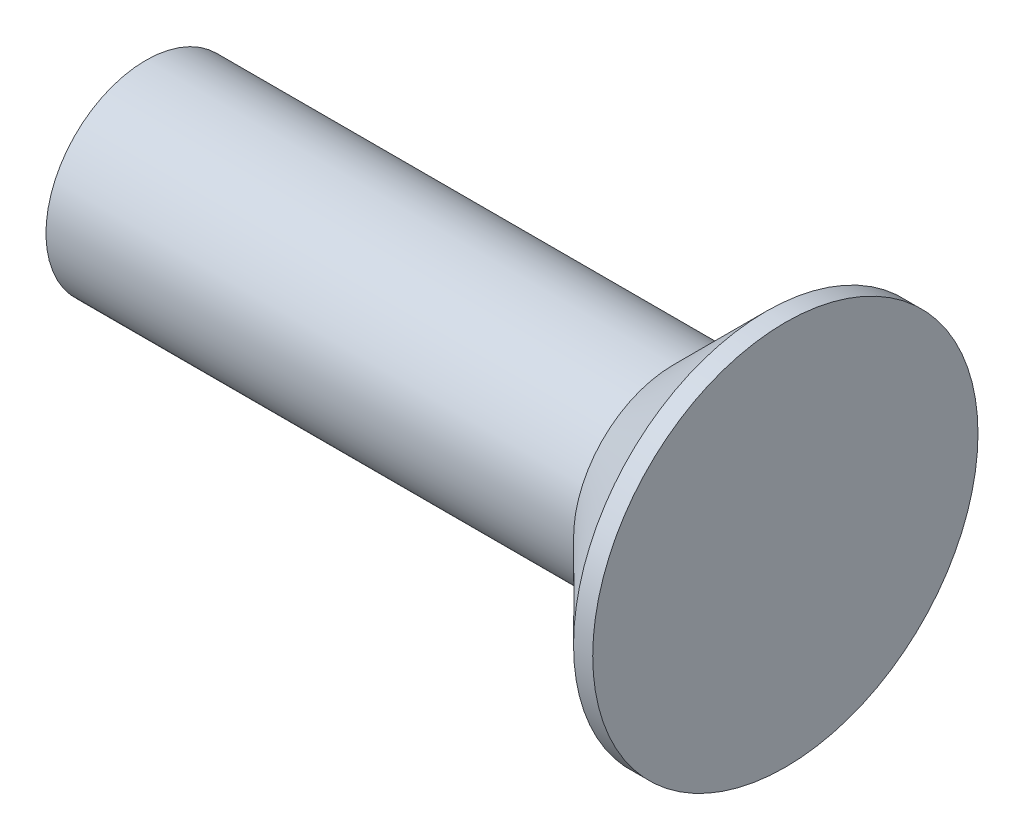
ISO-10303-21;
HEADER;
FILE_DESCRIPTION(('STEP AP214'),'2;1');
FILE_NAME('part.step','',(''),(''),'','','');
FILE_SCHEMA(('AUTOMOTIVE_DESIGN { 1 0 10303 214 1 1 1 1 }'));
ENDSEC;
DATA;
#1=APPLICATION_CONTEXT('core data for automotive mechanical design processes');
#2=APPLICATION_PROTOCOL_DEFINITION('international standard','automotive_design',2000,#1);
#3=PRODUCT_CONTEXT('',#1,'mechanical');
#4=PRODUCT('Part','Part','',(#3));
#5=PRODUCT_RELATED_PRODUCT_CATEGORY('part','',(#4));
#6=PRODUCT_DEFINITION_FORMATION('','',#4);
#7=PRODUCT_DEFINITION_CONTEXT('part definition',#1,'design');
#8=PRODUCT_DEFINITION('design','',#6,#7);
#9=PRODUCT_DEFINITION_SHAPE('','',#8);
#10=(LENGTH_UNIT() NAMED_UNIT(*) SI_UNIT(.MILLI.,.METRE.));
#11=(NAMED_UNIT(*) PLANE_ANGLE_UNIT() SI_UNIT($,.RADIAN.));
#12=(NAMED_UNIT(*) SI_UNIT($,.STERADIAN.) SOLID_ANGLE_UNIT());
#13=UNCERTAINTY_MEASURE_WITH_UNIT(LENGTH_MEASURE(1.E-05),#10,'distance_accuracy_value','');
#14=(GEOMETRIC_REPRESENTATION_CONTEXT(3) GLOBAL_UNCERTAINTY_ASSIGNED_CONTEXT((#13)) GLOBAL_UNIT_ASSIGNED_CONTEXT((#10,
#11,#12)) REPRESENTATION_CONTEXT('',''));
#15=CARTESIAN_POINT('',(0.,0.,0.));
#16=DIRECTION('',(0.,0.,1.));
#17=DIRECTION('',(1.,0.,0.));
#18=AXIS2_PLACEMENT_3D('',#15,#16,#17);
#19=CARTESIAN_POINT('',(-9.9,-5.50000000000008,-252.5));
#20=DIRECTION('',(1.,0.,0.));
#21=DIRECTION('',(0.,1.,0.));
#22=AXIS2_PLACEMENT_3D('',#19,#20,#21);
#23=CYLINDRICAL_SURFACE('',#22,2.5);
#24=CARTESIAN_POINT('',(-9.9,-5.50000000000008,-252.5));
#25=DIRECTION('',(1.,0.,0.));
#26=DIRECTION('',(0.,1.,0.));
#27=AXIS2_PLACEMENT_3D('',#24,#25,#26);
#28=CIRCLE('',#27,2.5);
#29=CARTESIAN_POINT('',(-9.9,-3.00000000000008,-252.5));
#30=VERTEX_POINT('',#29);
#31=EDGE_CURVE('E10',#30,#30,#28,.T.);
#32=ORIENTED_EDGE('',*,*,#31,.T.);
#33=EDGE_LOOP('',(#32));
#34=FACE_BOUND('',#33,.T.);
#35=CARTESIAN_POINT('',(3.3,-5.50000000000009,-252.5));
#36=DIRECTION('',(1.,0.,0.));
#37=DIRECTION('',(0.,1.,0.));
#38=AXIS2_PLACEMENT_3D('',#35,#36,#37);
#39=CIRCLE('',#38,2.5);
#40=CARTESIAN_POINT('',(3.3,-3.00000000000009,-252.5));
#41=VERTEX_POINT('',#40);
#42=EDGE_CURVE('E45',#41,#41,#39,.T.);
#43=ORIENTED_EDGE('',*,*,#42,.F.);
#44=EDGE_LOOP('',(#43));
#45=FACE_BOUND('',#44,.T.);
#46=ADVANCED_FACE('F31',(#34,#45),#23,.T.);
#47=CARTESIAN_POINT('',(-9.9,-3.00000000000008,-252.5));
#48=DIRECTION('',(-1.,0.,0.));
#49=DIRECTION('',(0.,-1.,0.));
#50=AXIS2_PLACEMENT_3D('',#47,#48,#49);
#51=PLANE('',#50);
#52=ORIENTED_EDGE('',*,*,#31,.F.);
#53=EDGE_LOOP('',(#52));
#54=FACE_BOUND('',#53,.T.);
#55=ADVANCED_FACE('F55',(#54),#51,.T.);
#56=CARTESIAN_POINT('',(6.1,-5.50000000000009,-252.5));
#57=DIRECTION('',(1.,0.,0.));
#58=DIRECTION('',(0.,1.,0.));
#59=AXIS2_PLACEMENT_3D('',#56,#57,#58);
#60=PLANE('',#59);
#61=CARTESIAN_POINT('',(6.1,-5.50000000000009,-252.5));
#62=DIRECTION('',(1.,0.,0.));
#63=DIRECTION('',(0.,1.,0.));
#64=AXIS2_PLACEMENT_3D('',#61,#62,#63);
#65=CIRCLE('',#64,4.82000000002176);
#66=CARTESIAN_POINT('',(6.1,-0.679999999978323,-252.5));
#67=VERTEX_POINT('',#66);
#68=EDGE_CURVE('E37',#67,#67,#65,.T.);
#69=ORIENTED_EDGE('',*,*,#68,.T.);
#70=EDGE_LOOP('',(#69));
#71=FACE_BOUND('',#70,.T.);
#72=ADVANCED_FACE('F59',(#71),#60,.T.);
#73=CARTESIAN_POINT('',(-9.9,-5.50000000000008,-252.5));
#74=DIRECTION('',(1.,0.,0.));
#75=DIRECTION('',(0.,1.,0.));
#76=AXIS2_PLACEMENT_3D('',#73,#74,#75);
#77=CYLINDRICAL_SURFACE('',#76,4.82000000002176);
#78=CARTESIAN_POINT('',(5.62000000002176,-5.50000000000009,-252.5));
#79=DIRECTION('',(1.,0.,0.));
#80=DIRECTION('',(0.,1.,0.));
#81=AXIS2_PLACEMENT_3D('',#78,#79,#80);
#82=CIRCLE('',#81,4.82000000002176);
#83=CARTESIAN_POINT('',(5.62000000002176,-0.679999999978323,-252.5));
#84=VERTEX_POINT('',#83);
#85=EDGE_CURVE('E41',#84,#84,#82,.T.);
#86=ORIENTED_EDGE('',*,*,#85,.T.);
#87=EDGE_LOOP('',(#86));
#88=FACE_BOUND('',#87,.T.);
#89=ORIENTED_EDGE('',*,*,#68,.F.);
#90=EDGE_LOOP('',(#89));
#91=FACE_BOUND('',#90,.T.);
#92=ADVANCED_FACE('F64',(#88,#91),#77,.T.);
#93=CARTESIAN_POINT('',(5.62000000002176,-5.50000000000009,-252.5));
#94=DIRECTION('',(1.,0.,0.));
#95=DIRECTION('',(0.,1.,0.));
#96=AXIS2_PLACEMENT_3D('',#93,#94,#95);
#97=CONICAL_SURFACE('',#96,4.82000000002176,0.785398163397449);
#98=ORIENTED_EDGE('',*,*,#42,.T.);
#99=EDGE_LOOP('',(#98));
#100=FACE_BOUND('',#99,.T.);
#101=ORIENTED_EDGE('',*,*,#85,.F.);
#102=EDGE_LOOP('',(#101));
#103=FACE_BOUND('',#102,.T.);
#104=ADVANCED_FACE('F51',(#100,#103),#97,.T.);
#105=CLOSED_SHELL('',(#46,#55,#72,#92,#104));
#106=MANIFOLD_SOLID_BREP('B2',#105);
#107=ADVANCED_BREP_SHAPE_REPRESENTATION('',(#18,#106),#14);
#108=SHAPE_DEFINITION_REPRESENTATION(#9,#107);
ENDSEC;
END-ISO-10303-21;
